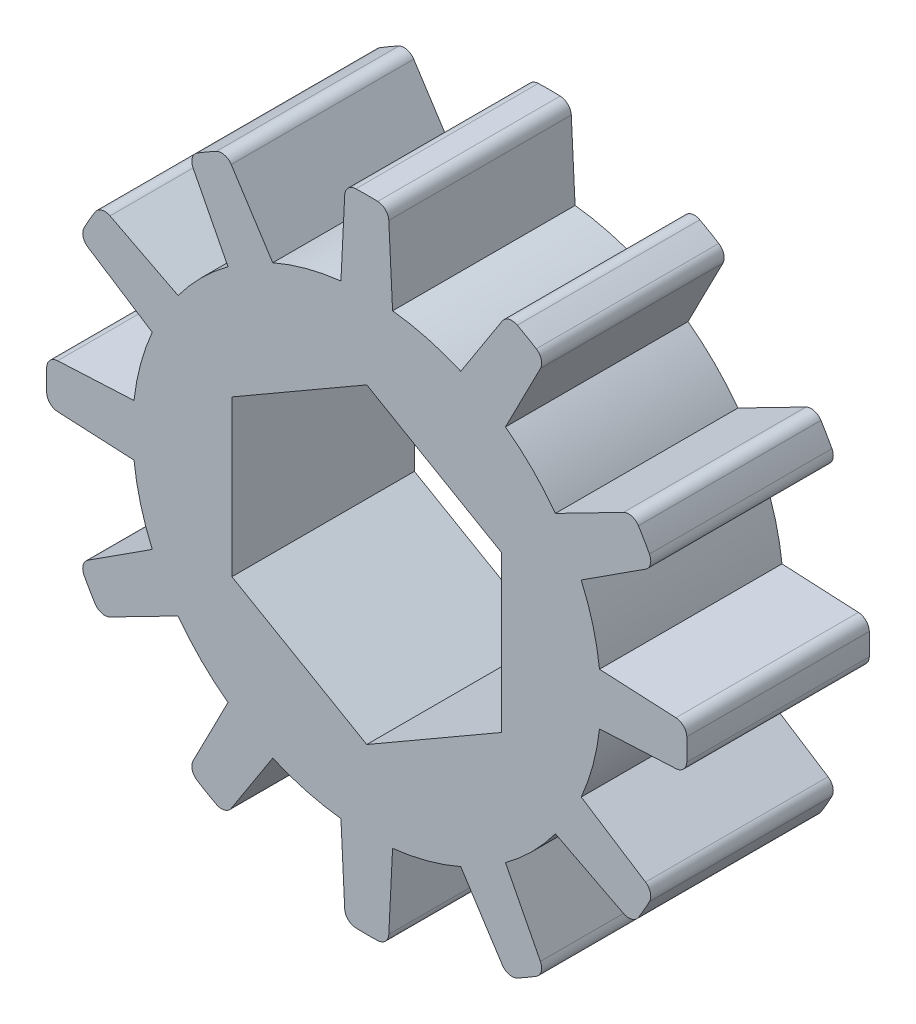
from build123d import *

# Parameters (mm, degrees)
CROQUIS1_R              = 0.5
SALIENTE_EXTRUIR1_DEPTH = 3.18
CORTAR_EXTRUIR3_DEPTH   = 9.508591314
REDONDEO1_R             = 0.2


with BuildPart() as part:
    # Croquis1 → Saliente-Extruir1 (new body)
    with BuildSketch(Plane.XY):
        with BuildLine():
            Line((0.375, 5.567875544), (0.45, 4.055600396))
            ThreePointArc((0.45, 4.055600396), (1.056108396, 3.941450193), (1.638088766, 3.737252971))
            Line((1.638088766, 3.737252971), (2.459178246, 5.009421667))
            ThreePointArc((2.459178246, 5.009421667), (2.790244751, 4.832845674), (3.108697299, 4.634421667))
            Line((3.108697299, 4.634421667), (2.41751163, 3.287252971))
            ThreePointArc((2.41751163, 3.287252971), (2.885341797, 2.885341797), (3.287252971, 2.41751163))
            Line((3.287252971, 2.41751163), (4.634421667, 3.108697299))
            ThreePointArc((4.634421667, 3.108697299), (4.832845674, 2.790244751), (5.009421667, 2.459178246))
            Line((5.009421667, 2.459178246), (3.737252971, 1.638088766))
            ThreePointArc((3.737252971, 1.638088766), (3.941450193, 1.056108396), (4.055600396, 0.45))
            Line((4.055600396, 0.45), (5.567875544, 0.375))
            ThreePointArc((5.567875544, 0.375), (5.580489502, 0), (5.567875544, -0.375))
            Line((5.567875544, -0.375), (4.055600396, -0.45))
            ThreePointArc((4.055600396, -0.45), (3.941450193, -1.056108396), (3.737252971, -1.638088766))
            Line((3.737252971, -1.638088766), (5.009421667, -2.459178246))
            ThreePointArc((5.009421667, -2.459178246), (4.832845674, -2.790244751), (4.634421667, -3.108697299))
            Line((4.634421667, -3.108697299), (3.287252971, -2.41751163))
            ThreePointArc((3.287252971, -2.41751163), (2.885341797, -2.885341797), (2.41751163, -3.287252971))
            Line((2.41751163, -3.287252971), (3.108697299, -4.634421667))
            ThreePointArc((3.108697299, -4.634421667), (2.790244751, -4.832845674), (2.459178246, -5.009421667))
            Line((2.459178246, -5.009421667), (1.638088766, -3.737252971))
            ThreePointArc((1.638088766, -3.737252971), (1.056108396, -3.941450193), (0.45, -4.055600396))
            Line((0.45, -4.055600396), (0.375, -5.567875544))
            ThreePointArc((0.375, -5.567875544), (0, -5.580489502), (-0.375, -5.567875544))
            Line((-0.375, -5.567875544), (-0.45, -4.055600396))
            ThreePointArc((-0.45, -4.055600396), (-1.056108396, -3.941450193), (-1.638088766, -3.737252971))
            Line((-1.638088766, -3.737252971), (-2.459178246, -5.009421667))
            ThreePointArc((-2.459178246, -5.009421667), (-2.790244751, -4.832845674), (-3.108697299, -4.634421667))
            Line((-3.108697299, -4.634421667), (-2.41751163, -3.287252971))
            ThreePointArc((-2.41751163, -3.287252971), (-2.885341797, -2.885341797), (-3.287252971, -2.41751163))
            Line((-3.287252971, -2.41751163), (-4.634421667, -3.108697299))
            ThreePointArc((-4.634421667, -3.108697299), (-4.832845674, -2.790244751), (-5.009421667, -2.459178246))
            Line((-5.009421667, -2.459178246), (-3.737252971, -1.638088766))
            ThreePointArc((-3.737252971, -1.638088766), (-3.941450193, -1.056108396), (-4.055600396, -0.45))
            Line((-4.055600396, -0.45), (-5.567875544, -0.375))
            ThreePointArc((-5.567875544, -0.375), (-5.580489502, 0), (-5.567875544, 0.375))
            Line((-5.567875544, 0.375), (-4.055600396, 0.45))
            ThreePointArc((-4.055600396, 0.45), (-3.941450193, 1.056108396), (-3.737252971, 1.638088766))
            Line((-3.737252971, 1.638088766), (-5.009421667, 2.459178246))
            ThreePointArc((-5.009421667, 2.459178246), (-4.832845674, 2.790244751), (-4.634421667, 3.108697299))
            Line((-4.634421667, 3.108697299), (-3.287252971, 2.41751163))
            ThreePointArc((-3.287252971, 2.41751163), (-2.885341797, 2.885341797), (-2.41751163, 3.287252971))
            Line((-2.41751163, 3.287252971), (-3.108697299, 4.634421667))
            ThreePointArc((-3.108697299, 4.634421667), (-2.790244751, 4.832845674), (-2.459178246, 5.009421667))
            Line((-2.459178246, 5.009421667), (-1.638088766, 3.737252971))
            ThreePointArc((-1.638088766, 3.737252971), (-1.056108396, 3.941450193), (-0.45, 4.055600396))
            Line((-0.45, 4.055600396), (-0.375, 5.567875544))
            ThreePointArc((-0.375, 5.567875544), (0, 5.580489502), (0.375, 5.567875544))
        make_face()
        Circle(CROQUIS1_R, mode=Mode.SUBTRACT)
    extrude(amount=SALIENTE_EXTRUIR1_DEPTH)

    # Croquis10 → Cortar-Extruir3 (cut, through all)
    with BuildSketch(Plane(origin=(0, 0, 0), x_dir=(-1, 0, 0), z_dir=(0, 0, -1))):
        Polygon((0, -2.713546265), (2.35, -1.356773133), (2.35, 1.356773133), (0, 2.713546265), (-2.35, 1.356773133), (-2.35, -1.356773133), align=None)
    extrude(amount=-CORTAR_EXTRUIR3_DEPTH, mode=Mode.SUBTRACT)

    # Redondeo1
    redondeo1_edges = [part.edges().sort_by_distance(p)[0] for p in [
        (0.375, 5.567875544, 1.59),
        (2.459178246, 5.009421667, 1.59),
        (3.108697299, 4.634421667, 1.59),
        (4.634421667, 3.108697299, 1.59),
        (5.009421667, 2.459178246, 1.59),
        (5.567875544, 0.375, 1.59),
        (5.567875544, -0.375, 1.59),
        (5.009421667, -2.459178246, 1.59),
        (4.634421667, -3.108697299, 1.59),
        (3.108697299, -4.634421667, 1.59),
        (2.459178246, -5.009421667, 1.59),
        (0.375, -5.567875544, 1.59),
        (-0.375, -5.567875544, 1.59),
        (-2.459178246, -5.009421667, 1.59),
        (-3.108697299, -4.634421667, 1.59),
        (-4.634421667, -3.108697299, 1.59),
        (-5.009421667, -2.459178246, 1.59),
        (-5.567875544, -0.375, 1.59),
        (-5.567875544, 0.375, 1.59),
        (-5.009421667, 2.459178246, 1.59),
        (-4.634421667, 3.108697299, 1.59),
        (-3.108697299, 4.634421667, 1.59),
        (-2.459178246, 5.009421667, 1.59),
        (-0.375, 5.567875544, 1.59),
    ]]
    fillet(redondeo1_edges, radius=REDONDEO1_R)


solid = part.part
